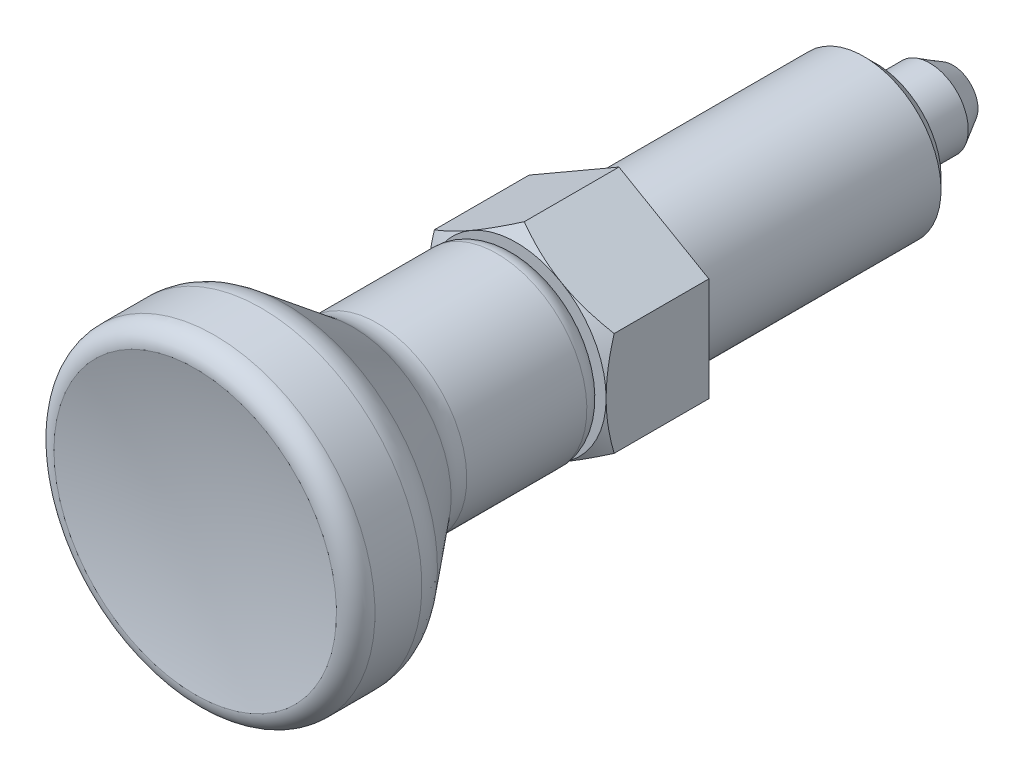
ISO-10303-21;
HEADER;
FILE_DESCRIPTION(('STEP AP214'),'2;1');
FILE_NAME('part.step','',(''),(''),'','','');
FILE_SCHEMA(('AUTOMOTIVE_DESIGN { 1 0 10303 214 1 1 1 1 }'));
ENDSEC;
DATA;
#1=APPLICATION_CONTEXT('core data for automotive mechanical design processes');
#2=APPLICATION_PROTOCOL_DEFINITION('international standard','automotive_design',2000,#1);
#3=PRODUCT_CONTEXT('',#1,'mechanical');
#4=PRODUCT('Part','Part','',(#3));
#5=PRODUCT_RELATED_PRODUCT_CATEGORY('part','',(#4));
#6=PRODUCT_DEFINITION_FORMATION('','',#4);
#7=PRODUCT_DEFINITION_CONTEXT('part definition',#1,'design');
#8=PRODUCT_DEFINITION('design','',#6,#7);
#9=PRODUCT_DEFINITION_SHAPE('','',#8);
#10=(LENGTH_UNIT() NAMED_UNIT(*) SI_UNIT(.MILLI.,.METRE.));
#11=(NAMED_UNIT(*) PLANE_ANGLE_UNIT() SI_UNIT($,.RADIAN.));
#12=(NAMED_UNIT(*) SI_UNIT($,.STERADIAN.) SOLID_ANGLE_UNIT());
#13=UNCERTAINTY_MEASURE_WITH_UNIT(LENGTH_MEASURE(1.E-05),#10,'distance_accuracy_value','');
#14=(GEOMETRIC_REPRESENTATION_CONTEXT(3) GLOBAL_UNCERTAINTY_ASSIGNED_CONTEXT((#13)) GLOBAL_UNIT_ASSIGNED_CONTEXT((#10,
#11,#12)) REPRESENTATION_CONTEXT('',''));
#15=CARTESIAN_POINT('',(0.,0.,0.));
#16=DIRECTION('',(0.,0.,1.));
#17=DIRECTION('',(1.,0.,0.));
#18=AXIS2_PLACEMENT_3D('',#15,#16,#17);
#19=CARTESIAN_POINT('',(0.,0.,5.1132486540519));
#20=DIRECTION('',(0.,0.,-1.));
#21=DIRECTION('',(0.,1.,0.));
#22=AXIS2_PLACEMENT_3D('',#19,#20,#21);
#23=CONICAL_SURFACE('',#22,12.,1.0471975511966);
#24=CARTESIAN_POINT('',(-7.,11.0353922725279,4.49647822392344));
#25=CARTESIAN_POINT('',(-7.,10.7281118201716,4.64624988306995));
#26=CARTESIAN_POINT('',(-7.,10.4201449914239,4.79463653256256));
#27=CARTESIAN_POINT('',(-7.,9.80247425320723,5.0878643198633));
#28=CARTESIAN_POINT('',(-7.,9.49277009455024,5.23270493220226));
#29=CARTESIAN_POINT('',(-7.,8.86974895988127,5.51875597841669));
#30=CARTESIAN_POINT('',(-7.,8.55642158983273,5.65994384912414));
#31=CARTESIAN_POINT('',(-7.,7.92733686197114,5.93677698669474));
#32=CARTESIAN_POINT('',(-7.,7.61157961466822,6.07242250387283));
#33=CARTESIAN_POINT('',(-7.,6.96625895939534,6.34124366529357));
#34=CARTESIAN_POINT('',(-7.,6.63659333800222,6.4741752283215));
#35=CARTESIAN_POINT('',(-7.,5.97347167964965,6.73040545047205));
#36=CARTESIAN_POINT('',(-7.,5.64001523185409,6.85370305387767));
#37=CARTESIAN_POINT('',(-7.,4.96935100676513,7.08755962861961));
#38=CARTESIAN_POINT('',(-7.,4.63215178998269,7.19814291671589));
#39=CARTESIAN_POINT('',(-7.,3.95291539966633,7.40314041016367));
#40=CARTESIAN_POINT('',(-7.,3.61087972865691,7.49755952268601));
#41=CARTESIAN_POINT('',(-7.,2.9237367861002,7.66530671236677));
#42=CARTESIAN_POINT('',(-7.,2.57865959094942,7.73875607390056));
#43=CARTESIAN_POINT('',(-7.,1.88398208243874,7.86053269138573));
#44=CARTESIAN_POINT('',(-7.,1.53438225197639,7.90886260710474));
#45=CARTESIAN_POINT('',(-7.,1.01031452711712,7.95931789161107));
#46=CARTESIAN_POINT('',(-7.,0.836864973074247,7.97244664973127));
#47=CARTESIAN_POINT('',(-7.,0.489558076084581,7.99135622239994));
#48=CARTESIAN_POINT('',(-7.,0.315700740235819,7.99713716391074));
#49=CARTESIAN_POINT('',(-7.,-0.0321006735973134,8.00120458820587));
#50=CARTESIAN_POINT('',(-7.,-0.206044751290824,7.99949109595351));
#51=CARTESIAN_POINT('',(-7.,-0.553702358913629,7.98861566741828));
#52=CARTESIAN_POINT('',(-7.,-0.727415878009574,7.97945339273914));
#53=CARTESIAN_POINT('',(-7.,-1.13958948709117,7.9490742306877));
#54=CARTESIAN_POINT('',(-7.,-1.37781635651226,7.92461864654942));
#55=CARTESIAN_POINT('',(-7.,-1.85260684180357,7.86299260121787));
#56=CARTESIAN_POINT('',(-7.,-2.08917024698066,7.82582055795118));
#57=CARTESIAN_POINT('',(-7.,-2.7960366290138,7.69719189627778));
#58=CARTESIAN_POINT('',(-7.,-3.26327635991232,7.58864282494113));
#59=CARTESIAN_POINT('',(-7.,-3.96216355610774,7.39907211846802));
#60=CARTESIAN_POINT('',(-7.,-4.19739940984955,7.33050662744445));
#61=CARTESIAN_POINT('',(-7.,-4.66559036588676,7.18591768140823));
#62=CARTESIAN_POINT('',(-7.,-4.89854545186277,7.10989417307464));
#63=CARTESIAN_POINT('',(-7.,-5.36224165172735,6.95163657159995));
#64=CARTESIAN_POINT('',(-7.,-5.59298338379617,6.86940427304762));
#65=CARTESIAN_POINT('',(-7.,-6.05253286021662,6.69972997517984));
#66=CARTESIAN_POINT('',(-7.,-6.28134063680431,6.6122880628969));
#67=CARTESIAN_POINT('',(-7.,-6.85526417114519,6.38665091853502));
#68=CARTESIAN_POINT('',(-7.,-7.19926287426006,6.24561832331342));
#69=CARTESIAN_POINT('',(-7.,-7.88401339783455,5.95585423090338));
#70=CARTESIAN_POINT('',(-7.,-8.22476494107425,5.80712208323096));
#71=CARTESIAN_POINT('',(-7.,-8.90368697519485,5.50362622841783));
#72=CARTESIAN_POINT('',(-7.,-9.24185665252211,5.3488607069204));
#73=CARTESIAN_POINT('',(-7.,-9.91598083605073,5.03461804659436));
#74=CARTESIAN_POINT('',(-7.,-10.2519354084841,4.87514104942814));
#75=CARTESIAN_POINT('',(-7.,-10.9224864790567,4.55220470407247));
#76=CARTESIAN_POINT('',(-7.,-11.2570804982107,4.38874021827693));
#77=CARTESIAN_POINT('',(-7.,-11.924759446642,4.0587581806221));
#78=CARTESIAN_POINT('',(-7.,-12.2578443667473,3.89224061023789));
#79=CARTESIAN_POINT('',(-7.,-13.2551078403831,3.389035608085));
#80=CARTESIAN_POINT('',(-7.,-13.9174138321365,3.04863817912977));
#81=CARTESIAN_POINT('',(-7.,-15.1762917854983,2.39342447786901));
#82=CARTESIAN_POINT('',(-7.,-15.7731820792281,2.07921690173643));
#83=CARTESIAN_POINT('',(-7.,-16.9647946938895,1.44665138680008));
#84=CARTESIAN_POINT('',(-7.,-17.559516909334,1.12829324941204));
#85=CARTESIAN_POINT('',(-7.,-18.7455029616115,0.489419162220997));
#86=CARTESIAN_POINT('',(-7.,-19.3367718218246,0.168912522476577));
#87=CARTESIAN_POINT('',(-7.,-20.5179415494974,-0.474518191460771));
#88=CARTESIAN_POINT('',(-7.,-21.1078425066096,-0.797442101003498));
#89=CARTESIAN_POINT('',(-7.,-21.6972508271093,-1.12125672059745));
#90=B_SPLINE_CURVE_WITH_KNOTS('',3,(#24,#25,#26,#27,#28,#29,#30,#31,#32,#33,#34,#35,#36,#37,#38,
#39,#40,#41,#42,#43,#44,#45,#46,#47,#48,#49,#50,#51,#52,#53,#54,#55,#56,#57,#58,#59,#60,#61,#62,
#63,#64,#65,#66,#67,#68,#69,#70,#71,#72,#73,#74,#75,#76,#77,#78,#79,#80,#81,#82,#83,#84,#85,#86,
#87,#88,#89),.UNSPECIFIED.,.F.,.F.,(4,2,2,2,2,2,2,2,2,2,2,2,2,2,2,2,2,2,2,2,2,2,2,2,2,2,2,2,2,2,
2,2,4),(0.,1.02552397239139,2.05119900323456,3.08216150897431,4.11307740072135,5.17933435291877,
6.2457079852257,7.31000695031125,8.37398223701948,9.43167293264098,10.489251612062,
11.0109568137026,11.5326530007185,12.0543474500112,12.5760656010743,13.2941001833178,
14.0122241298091,15.4491895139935,16.1841975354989,16.9192108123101,17.6540124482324,
18.3888018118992,19.5040292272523,20.6193510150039,21.7350108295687,22.85063713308,
23.9677859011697,25.0849414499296,27.3188565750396,29.3424599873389,31.3661605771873,
33.383804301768,35.4013118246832),.UNSPECIFIED.);
#91=CARTESIAN_POINT('',(-7.,-4.0414518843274,7.37478521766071));
#92=VERTEX_POINT('',#91);
#93=CARTESIAN_POINT('',(-7.,0.,8.));
#94=VERTEX_POINT('',#93);
#95=EDGE_CURVE('E9',#92,#94,#90,.F.);
#96=ORIENTED_EDGE('',*,*,#95,.F.);
#97=CARTESIAN_POINT('',(0.000200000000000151,-8.08301923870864,7.37471854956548));
#98=CARTESIAN_POINT('',(-0.153667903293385,-7.99418356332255,7.42600015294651));
#99=CARTESIAN_POINT('',(-0.308109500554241,-7.90501666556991,7.47495440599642));
#100=CARTESIAN_POINT('',(-0.618246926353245,-7.72595873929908,7.56756721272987));
#101=CARTESIAN_POINT('',(-0.773943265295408,-7.63606741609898,7.61122348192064));
#102=CARTESIAN_POINT('',(-1.24352516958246,-7.36495417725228,7.73338840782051));
#103=CARTESIAN_POINT('',(-1.5592643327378,-7.18266208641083,7.80287444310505));
#104=CARTESIAN_POINT('',(-2.03176224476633,-6.90986528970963,7.88435504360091));
#105=CARTESIAN_POINT('',(-2.18710922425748,-6.82017566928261,7.90756651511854));
#106=CARTESIAN_POINT('',(-2.49850511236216,-6.64039116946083,7.94648878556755));
#107=CARTESIAN_POINT('',(-2.65455395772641,-6.55029632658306,7.96220024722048));
#108=CARTESIAN_POINT('',(-2.96692267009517,-6.36995016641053,7.98572208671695));
#109=CARTESIAN_POINT('',(-3.12324202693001,-6.27969914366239,7.99354143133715));
#110=CARTESIAN_POINT('',(-3.43601650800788,-6.09911871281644,8.0011197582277));
#111=CARTESIAN_POINT('',(-3.59247162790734,-6.00878930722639,8.00087898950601));
#112=CARTESIAN_POINT('',(-4.02110687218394,-5.76131663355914,7.98914026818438));
#113=CARTESIAN_POINT('',(-4.29314668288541,-5.60425437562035,7.96943425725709));
#114=CARTESIAN_POINT('',(-4.8354194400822,-5.29117305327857,7.90694653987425));
#115=CARTESIAN_POINT('',(-5.10565047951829,-5.13515508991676,7.86414347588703));
#116=CARTESIAN_POINT('',(-5.64901454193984,-4.8214437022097,7.75714832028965));
#117=CARTESIAN_POINT('',(-5.92207900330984,-4.66378986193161,7.69250290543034));
#118=CARTESIAN_POINT('',(-6.46413578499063,-4.35083323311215,7.54578392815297));
#119=CARTESIAN_POINT('',(-6.73313504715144,-4.19552643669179,7.46374482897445));
#120=CARTESIAN_POINT('',(-7.0002,-4.04133641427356,7.3747185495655));
#121=B_SPLINE_CURVE_WITH_KNOTS('',3,(#97,#98,#99,#100,#101,#102,#103,#104,#105,#106,#107,#108,
#109,#110,#111,#112,#113,#114,#115,#116,#117,#118,#119,#120),.UNSPECIFIED.,.F.,.F.,(4,2,2,2,2,2,
2,2,2,2,2,4),(0.,0.554727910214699,1.1096941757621,2.22193274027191,2.76443041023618,
3.30688013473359,3.84871284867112,4.39052882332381,5.33376515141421,6.27787517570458,
7.24292418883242,8.20607866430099),.UNSPECIFIED.);
#122=CARTESIAN_POINT('',(-3.5,-6.06217782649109,8.));
#123=VERTEX_POINT('',#122);
#124=EDGE_CURVE('E204',#123,#92,#121,.T.);
#125=ORIENTED_EDGE('',*,*,#124,.F.);
#126=CARTESIAN_POINT('',(0.,0.,8.));
#127=DIRECTION('',(0.,0.,1.));
#128=DIRECTION('',(0.,-1.,0.));
#129=AXIS2_PLACEMENT_3D('',#126,#127,#128);
#130=CIRCLE('',#129,7.);
#131=EDGE_CURVE('E262',#94,#123,#130,.T.);
#132=ORIENTED_EDGE('',*,*,#131,.F.);
#133=EDGE_LOOP('',(#96,#125,#132));
#134=FACE_BOUND('',#133,.T.);
#135=ADVANCED_FACE('F14',(#134),#23,.T.);
#136=CARTESIAN_POINT('',(-7.,4.0414518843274,7.37478521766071));
#137=VERTEX_POINT('',#136);
#138=EDGE_CURVE('E18',#94,#137,#90,.F.);
#139=ORIENTED_EDGE('',*,*,#138,.F.);
#140=CARTESIAN_POINT('',(-3.5,6.06217782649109,8.));
#141=VERTEX_POINT('',#140);
#142=EDGE_CURVE('E116',#141,#94,#130,.T.);
#143=ORIENTED_EDGE('',*,*,#142,.F.);
#144=CARTESIAN_POINT('',(-7.0002,4.04133641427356,7.3747185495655));
#145=CARTESIAN_POINT('',(-6.84633209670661,4.13017208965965,7.42600015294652));
#146=CARTESIAN_POINT('',(-6.69189049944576,4.21933898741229,7.47495440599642));
#147=CARTESIAN_POINT('',(-6.38175307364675,4.39839691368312,7.56756721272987));
#148=CARTESIAN_POINT('',(-6.22605673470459,4.48828823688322,7.61122348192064));
#149=CARTESIAN_POINT('',(-5.75647483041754,4.75940147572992,7.73338840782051));
#150=CARTESIAN_POINT('',(-5.4407356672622,4.94169356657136,7.80287444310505));
#151=CARTESIAN_POINT('',(-4.96823775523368,5.21449036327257,7.88435504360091));
#152=CARTESIAN_POINT('',(-4.81289077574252,5.30417998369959,7.90756651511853));
#153=CARTESIAN_POINT('',(-4.50149488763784,5.48396448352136,7.94648878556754));
#154=CARTESIAN_POINT('',(-4.3454460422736,5.57405932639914,7.96220024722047));
#155=CARTESIAN_POINT('',(-4.03307732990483,5.75440548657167,7.98572208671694));
#156=CARTESIAN_POINT('',(-3.87675797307,5.84465650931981,7.99354143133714));
#157=CARTESIAN_POINT('',(-3.56398349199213,6.02523694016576,8.00111975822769));
#158=CARTESIAN_POINT('',(-3.40752837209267,6.11556634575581,8.000878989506));
#159=CARTESIAN_POINT('',(-2.97889312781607,6.36303901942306,7.98914026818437));
#160=CARTESIAN_POINT('',(-2.7068533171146,6.52010127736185,7.96943425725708));
#161=CARTESIAN_POINT('',(-2.1645805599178,6.83318259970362,7.90694653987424));
#162=CARTESIAN_POINT('',(-1.89434952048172,6.98920056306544,7.86414347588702));
#163=CARTESIAN_POINT('',(-1.35098545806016,7.3029119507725,7.75714832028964));
#164=CARTESIAN_POINT('',(-1.07792099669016,7.46056579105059,7.69250290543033));
#165=CARTESIAN_POINT('',(-0.535864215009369,7.77352241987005,7.54578392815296));
#166=CARTESIAN_POINT('',(-0.266864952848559,7.92882921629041,7.46374482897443));
#167=CARTESIAN_POINT('',(0.00019999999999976,8.08301923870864,7.37471854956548));
#168=B_SPLINE_CURVE_WITH_KNOTS('',3,(#144,#145,#146,#147,#148,#149,#150,#151,#152,#153,#154,
#155,#156,#157,#158,#159,#160,#161,#162,#163,#164,#165,#166,#167),.UNSPECIFIED.,.F.,.F.,(4,2,2,
2,2,2,2,2,2,2,2,4),(0.,0.554727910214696,1.10969417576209,2.2219327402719,2.76443041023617,
3.30688013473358,3.8487128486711,4.3905288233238,5.3337651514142,6.27787517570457,
7.24292418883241,8.20607866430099),.UNSPECIFIED.);
#169=EDGE_CURVE('E265',#137,#141,#168,.T.);
#170=ORIENTED_EDGE('',*,*,#169,.F.);
#171=EDGE_LOOP('',(#139,#143,#170));
#172=FACE_BOUND('',#171,.T.);
#173=ADVANCED_FACE('F226',(#172),#23,.T.);
#174=CARTESIAN_POINT('',(0.,8.0829037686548,7.3747852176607));
#175=VERTEX_POINT('',#174);
#176=EDGE_CURVE('E112',#141,#175,#168,.T.);
#177=ORIENTED_EDGE('',*,*,#176,.F.);
#178=CARTESIAN_POINT('',(3.5,6.06217782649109,8.));
#179=VERTEX_POINT('',#178);
#180=EDGE_CURVE('E110',#179,#141,#130,.T.);
#181=ORIENTED_EDGE('',*,*,#180,.F.);
#182=CARTESIAN_POINT('',(-0.000200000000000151,8.08301923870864,7.37471854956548));
#183=CARTESIAN_POINT('',(0.153667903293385,7.99418356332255,7.42600015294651));
#184=CARTESIAN_POINT('',(0.308109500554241,7.90501666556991,7.47495440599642));
#185=CARTESIAN_POINT('',(0.618246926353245,7.72595873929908,7.56756721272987));
#186=CARTESIAN_POINT('',(0.773943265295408,7.63606741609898,7.61122348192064));
#187=CARTESIAN_POINT('',(1.24352516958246,7.36495417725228,7.73338840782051));
#188=CARTESIAN_POINT('',(1.5592643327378,7.18266208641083,7.80287444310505));
#189=CARTESIAN_POINT('',(2.03176224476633,6.90986528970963,7.88435504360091));
#190=CARTESIAN_POINT('',(2.18710922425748,6.82017566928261,7.90756651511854));
#191=CARTESIAN_POINT('',(2.49850511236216,6.64039116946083,7.94648878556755));
#192=CARTESIAN_POINT('',(2.65455395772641,6.55029632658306,7.96220024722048));
#193=CARTESIAN_POINT('',(2.96692267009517,6.36995016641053,7.98572208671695));
#194=CARTESIAN_POINT('',(3.12324202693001,6.27969914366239,7.99354143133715));
#195=CARTESIAN_POINT('',(3.43601650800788,6.09911871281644,8.0011197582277));
#196=CARTESIAN_POINT('',(3.59247162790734,6.00878930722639,8.00087898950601));
#197=CARTESIAN_POINT('',(4.02110687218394,5.76131663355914,7.98914026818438));
#198=CARTESIAN_POINT('',(4.29314668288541,5.60425437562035,7.96943425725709));
#199=CARTESIAN_POINT('',(4.8354194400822,5.29117305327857,7.90694653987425));
#200=CARTESIAN_POINT('',(5.10565047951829,5.13515508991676,7.86414347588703));
#201=CARTESIAN_POINT('',(5.64901454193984,4.8214437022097,7.75714832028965));
#202=CARTESIAN_POINT('',(5.92207900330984,4.66378986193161,7.69250290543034));
#203=CARTESIAN_POINT('',(6.46413578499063,4.35083323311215,7.54578392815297));
#204=CARTESIAN_POINT('',(6.73313504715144,4.19552643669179,7.46374482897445));
#205=CARTESIAN_POINT('',(7.0002,4.04133641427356,7.3747185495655));
#206=B_SPLINE_CURVE_WITH_KNOTS('',3,(#182,#183,#184,#185,#186,#187,#188,#189,#190,#191,#192,
#193,#194,#195,#196,#197,#198,#199,#200,#201,#202,#203,#204,#205),.UNSPECIFIED.,.F.,.F.,(4,2,2,
2,2,2,2,2,2,2,2,4),(0.,0.554727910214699,1.1096941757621,2.22193274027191,2.76443041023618,
3.30688013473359,3.84871284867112,4.39052882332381,5.33376515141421,6.27787517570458,
7.24292418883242,8.20607866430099),.UNSPECIFIED.);
#207=EDGE_CURVE('E90',#175,#179,#206,.T.);
#208=ORIENTED_EDGE('',*,*,#207,.F.);
#209=EDGE_LOOP('',(#177,#181,#208));
#210=FACE_BOUND('',#209,.T.);
#211=ADVANCED_FACE('F111',(#210),#23,.T.);
#212=CARTESIAN_POINT('',(0.,-8.0829037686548,7.3747852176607));
#213=VERTEX_POINT('',#212);
#214=EDGE_CURVE('E199',#213,#123,#121,.T.);
#215=ORIENTED_EDGE('',*,*,#214,.F.);
#216=CARTESIAN_POINT('',(7.0002,-4.04133641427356,7.3747185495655));
#217=CARTESIAN_POINT('',(6.84633209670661,-4.13017208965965,7.42600015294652));
#218=CARTESIAN_POINT('',(6.69189049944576,-4.21933898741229,7.47495440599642));
#219=CARTESIAN_POINT('',(6.38175307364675,-4.39839691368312,7.56756721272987));
#220=CARTESIAN_POINT('',(6.22605673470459,-4.48828823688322,7.61122348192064));
#221=CARTESIAN_POINT('',(5.75647483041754,-4.75940147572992,7.73338840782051));
#222=CARTESIAN_POINT('',(5.4407356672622,-4.94169356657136,7.80287444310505));
#223=CARTESIAN_POINT('',(4.96823775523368,-5.21449036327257,7.88435504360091));
#224=CARTESIAN_POINT('',(4.81289077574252,-5.30417998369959,7.90756651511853));
#225=CARTESIAN_POINT('',(4.50149488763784,-5.48396448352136,7.94648878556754));
#226=CARTESIAN_POINT('',(4.3454460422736,-5.57405932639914,7.96220024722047));
#227=CARTESIAN_POINT('',(4.03307732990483,-5.75440548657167,7.98572208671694));
#228=CARTESIAN_POINT('',(3.87675797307,-5.84465650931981,7.99354143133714));
#229=CARTESIAN_POINT('',(3.56398349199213,-6.02523694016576,8.00111975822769));
#230=CARTESIAN_POINT('',(3.40752837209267,-6.11556634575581,8.000878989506));
#231=CARTESIAN_POINT('',(2.97889312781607,-6.36303901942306,7.98914026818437));
#232=CARTESIAN_POINT('',(2.7068533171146,-6.52010127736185,7.96943425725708));
#233=CARTESIAN_POINT('',(2.1645805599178,-6.83318259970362,7.90694653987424));
#234=CARTESIAN_POINT('',(1.89434952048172,-6.98920056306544,7.86414347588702));
#235=CARTESIAN_POINT('',(1.35098545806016,-7.3029119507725,7.75714832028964));
#236=CARTESIAN_POINT('',(1.07792099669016,-7.46056579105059,7.69250290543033));
#237=CARTESIAN_POINT('',(0.535864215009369,-7.77352241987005,7.54578392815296));
#238=CARTESIAN_POINT('',(0.266864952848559,-7.92882921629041,7.46374482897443));
#239=CARTESIAN_POINT('',(-0.00019999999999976,-8.08301923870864,7.37471854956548));
#240=B_SPLINE_CURVE_WITH_KNOTS('',3,(#216,#217,#218,#219,#220,#221,#222,#223,#224,#225,#226,
#227,#228,#229,#230,#231,#232,#233,#234,#235,#236,#237,#238,#239),.UNSPECIFIED.,.F.,.F.,(4,2,2,
2,2,2,2,2,2,2,2,4),(0.,0.554727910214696,1.10969417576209,2.2219327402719,2.76443041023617,
3.30688013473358,3.8487128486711,4.3905288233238,5.3337651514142,6.27787517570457,
7.24292418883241,8.20607866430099),.UNSPECIFIED.);
#241=CARTESIAN_POINT('',(3.5,-6.06217782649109,8.));
#242=VERTEX_POINT('',#241);
#243=EDGE_CURVE('E100',#242,#213,#240,.T.);
#244=ORIENTED_EDGE('',*,*,#243,.F.);
#245=EDGE_CURVE('E123',#123,#242,#130,.T.);
#246=ORIENTED_EDGE('',*,*,#245,.F.);
#247=EDGE_LOOP('',(#215,#244,#246));
#248=FACE_BOUND('',#247,.T.);
#249=ADVANCED_FACE('F244',(#248),#23,.T.);
#250=CARTESIAN_POINT('',(7.,4.0414518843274,7.37478521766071));
#251=VERTEX_POINT('',#250);
#252=EDGE_CURVE('E94',#179,#251,#206,.T.);
#253=ORIENTED_EDGE('',*,*,#252,.F.);
#254=CARTESIAN_POINT('',(7.,0.,8.));
#255=VERTEX_POINT('',#254);
#256=EDGE_CURVE('E106',#255,#179,#130,.T.);
#257=ORIENTED_EDGE('',*,*,#256,.F.);
#258=CARTESIAN_POINT('',(7.,11.0353922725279,4.49647822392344));
#259=CARTESIAN_POINT('',(7.,10.7281118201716,4.64624988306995));
#260=CARTESIAN_POINT('',(7.,10.4201449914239,4.79463653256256));
#261=CARTESIAN_POINT('',(7.,9.80247425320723,5.0878643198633));
#262=CARTESIAN_POINT('',(7.,9.49277009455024,5.23270493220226));
#263=CARTESIAN_POINT('',(7.,8.86974895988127,5.51875597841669));
#264=CARTESIAN_POINT('',(7.,8.55642158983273,5.65994384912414));
#265=CARTESIAN_POINT('',(7.,7.92733686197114,5.93677698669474));
#266=CARTESIAN_POINT('',(7.,7.61157961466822,6.07242250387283));
#267=CARTESIAN_POINT('',(7.,6.96625895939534,6.34124366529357));
#268=CARTESIAN_POINT('',(7.,6.63659333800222,6.4741752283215));
#269=CARTESIAN_POINT('',(7.,5.97347167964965,6.73040545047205));
#270=CARTESIAN_POINT('',(7.,5.64001523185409,6.85370305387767));
#271=CARTESIAN_POINT('',(7.,4.96935100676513,7.08755962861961));
#272=CARTESIAN_POINT('',(7.,4.63215178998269,7.19814291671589));
#273=CARTESIAN_POINT('',(7.,3.95291539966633,7.40314041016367));
#274=CARTESIAN_POINT('',(7.,3.61087972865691,7.49755952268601));
#275=CARTESIAN_POINT('',(7.,2.9237367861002,7.66530671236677));
#276=CARTESIAN_POINT('',(7.,2.57865959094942,7.73875607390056));
#277=CARTESIAN_POINT('',(7.,1.88398208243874,7.86053269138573));
#278=CARTESIAN_POINT('',(7.,1.53438225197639,7.90886260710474));
#279=CARTESIAN_POINT('',(7.,1.01031452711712,7.95931789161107));
#280=CARTESIAN_POINT('',(7.,0.836864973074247,7.97244664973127));
#281=CARTESIAN_POINT('',(7.,0.489558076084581,7.99135622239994));
#282=CARTESIAN_POINT('',(7.,0.315700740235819,7.99713716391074));
#283=CARTESIAN_POINT('',(7.,-0.0321006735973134,8.00120458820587));
#284=CARTESIAN_POINT('',(7.,-0.206044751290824,7.99949109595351));
#285=CARTESIAN_POINT('',(7.,-0.553702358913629,7.98861566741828));
#286=CARTESIAN_POINT('',(7.,-0.727415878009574,7.97945339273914));
#287=CARTESIAN_POINT('',(7.,-1.13958948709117,7.9490742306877));
#288=CARTESIAN_POINT('',(7.,-1.37781635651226,7.92461864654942));
#289=CARTESIAN_POINT('',(7.,-1.85260684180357,7.86299260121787));
#290=CARTESIAN_POINT('',(7.,-2.08917024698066,7.82582055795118));
#291=CARTESIAN_POINT('',(7.,-2.7960366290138,7.69719189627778));
#292=CARTESIAN_POINT('',(7.,-3.26327635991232,7.58864282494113));
#293=CARTESIAN_POINT('',(7.,-3.96216355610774,7.39907211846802));
#294=CARTESIAN_POINT('',(7.,-4.19739940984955,7.33050662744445));
#295=CARTESIAN_POINT('',(7.,-4.66559036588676,7.18591768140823));
#296=CARTESIAN_POINT('',(7.,-4.89854545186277,7.10989417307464));
#297=CARTESIAN_POINT('',(7.,-5.36224165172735,6.95163657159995));
#298=CARTESIAN_POINT('',(7.,-5.59298338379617,6.86940427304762));
#299=CARTESIAN_POINT('',(7.,-6.05253286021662,6.69972997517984));
#300=CARTESIAN_POINT('',(7.,-6.28134063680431,6.6122880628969));
#301=CARTESIAN_POINT('',(7.,-6.85526417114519,6.38665091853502));
#302=CARTESIAN_POINT('',(7.,-7.19926287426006,6.24561832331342));
#303=CARTESIAN_POINT('',(7.,-7.88401339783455,5.95585423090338));
#304=CARTESIAN_POINT('',(7.,-8.22476494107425,5.80712208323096));
#305=CARTESIAN_POINT('',(7.,-8.90368697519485,5.50362622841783));
#306=CARTESIAN_POINT('',(7.,-9.24185665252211,5.3488607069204));
#307=CARTESIAN_POINT('',(7.,-9.91598083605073,5.03461804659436));
#308=CARTESIAN_POINT('',(7.,-10.2519354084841,4.87514104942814));
#309=CARTESIAN_POINT('',(7.,-10.9224864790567,4.55220470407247));
#310=CARTESIAN_POINT('',(7.,-11.2570804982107,4.38874021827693));
#311=CARTESIAN_POINT('',(7.,-11.924759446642,4.0587581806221));
#312=CARTESIAN_POINT('',(7.,-12.2578443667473,3.89224061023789));
#313=CARTESIAN_POINT('',(7.,-13.2551078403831,3.389035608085));
#314=CARTESIAN_POINT('',(7.,-13.9174138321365,3.04863817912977));
#315=CARTESIAN_POINT('',(7.,-15.1762917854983,2.39342447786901));
#316=CARTESIAN_POINT('',(7.,-15.7731820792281,2.07921690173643));
#317=CARTESIAN_POINT('',(7.,-16.9647946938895,1.44665138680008));
#318=CARTESIAN_POINT('',(7.,-17.559516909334,1.12829324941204));
#319=CARTESIAN_POINT('',(7.,-18.7455029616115,0.489419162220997));
#320=CARTESIAN_POINT('',(7.,-19.3367718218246,0.168912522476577));
#321=CARTESIAN_POINT('',(7.,-20.5179415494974,-0.474518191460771));
#322=CARTESIAN_POINT('',(7.,-21.1078425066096,-0.797442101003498));
#323=CARTESIAN_POINT('',(7.,-21.6972508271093,-1.12125672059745));
#324=B_SPLINE_CURVE_WITH_KNOTS('',3,(#258,#259,#260,#261,#262,#263,#264,#265,#266,#267,#268,
#269,#270,#271,#272,#273,#274,#275,#276,#277,#278,#279,#280,#281,#282,#283,#284,#285,#286,#287,
#288,#289,#290,#291,#292,#293,#294,#295,#296,#297,#298,#299,#300,#301,#302,#303,#304,#305,#306,
#307,#308,#309,#310,#311,#312,#313,#314,#315,#316,#317,#318,#319,#320,#321,#322,#323),
.UNSPECIFIED.,.F.,.F.,(4,2,2,2,2,2,2,2,2,2,2,2,2,2,2,2,2,2,2,2,2,2,2,2,2,2,2,2,2,2,2,2,4),(0.,
1.02552397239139,2.05119900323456,3.08216150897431,4.11307740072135,5.17933435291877,
6.2457079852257,7.31000695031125,8.37398223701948,9.43167293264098,10.489251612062,
11.0109568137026,11.5326530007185,12.0543474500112,12.5760656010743,13.2941001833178,
14.0122241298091,15.4491895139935,16.1841975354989,16.9192108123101,17.6540124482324,
18.3888018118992,19.5040292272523,20.6193510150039,21.7350108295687,22.85063713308,
23.9677859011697,25.0849414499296,27.3188565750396,29.3424599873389,31.3661605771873,
33.383804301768,35.4013118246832),.UNSPECIFIED.);
#325=EDGE_CURVE('E41',#251,#255,#324,.T.);
#326=ORIENTED_EDGE('',*,*,#325,.F.);
#327=EDGE_LOOP('',(#253,#257,#326));
#328=FACE_BOUND('',#327,.T.);
#329=ADVANCED_FACE('F104',(#328),#23,.T.);
#330=CARTESIAN_POINT('',(7.,-4.0414518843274,7.37478521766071));
#331=VERTEX_POINT('',#330);
#332=EDGE_CURVE('E108',#331,#242,#240,.T.);
#333=ORIENTED_EDGE('',*,*,#332,.F.);
#334=EDGE_CURVE('E169',#255,#331,#324,.T.);
#335=ORIENTED_EDGE('',*,*,#334,.F.);
#336=EDGE_CURVE('E121',#242,#255,#130,.T.);
#337=ORIENTED_EDGE('',*,*,#336,.F.);
#338=EDGE_LOOP('',(#333,#335,#337));
#339=FACE_BOUND('',#338,.T.);
#340=ADVANCED_FACE('F228',(#339),#23,.T.);
#341=CARTESIAN_POINT('',(3.33760796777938E-12,0.,81.7749935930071));
#342=DIRECTION('',(0.,0.,1.));
#343=DIRECTION('',(-1.,0.,0.));
#344=AXIS2_PLACEMENT_3D('',#341,#342,#343);
#345=SPHERICAL_SURFACE('',#344,49.9999999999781);
#346=CARTESIAN_POINT('',(0.,0.,33.));
#347=DIRECTION('',(0.,0.,1.));
#348=DIRECTION('',(0.,-1.,0.));
#349=AXIS2_PLACEMENT_3D('',#346,#347,#348);
#350=CIRCLE('',#349,11.);
#351=CARTESIAN_POINT('',(0.,-11.,33.));
#352=VERTEX_POINT('',#351);
#353=EDGE_CURVE('E166',#352,#352,#350,.T.);
#354=ORIENTED_EDGE('',*,*,#353,.T.);
#355=EDGE_LOOP('',(#354));
#356=FACE_BOUND('',#355,.T.);
#357=ADVANCED_FACE('F16',(#356),#345,.F.);
#358=CARTESIAN_POINT('',(0.,0.,31.5000000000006));
#359=DIRECTION('',(0.,0.,1.));
#360=DIRECTION('',(0.,-1.,0.));
#361=AXIS2_PLACEMENT_3D('',#358,#359,#360);
#362=TOROIDAL_SURFACE('',#361,11.0000000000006,1.49999999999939);
#363=CARTESIAN_POINT('',(0.,0.,31.5));
#364=DIRECTION('',(0.,0.,1.));
#365=DIRECTION('',(0.,-1.,0.));
#366=AXIS2_PLACEMENT_3D('',#363,#364,#365);
#367=CIRCLE('',#366,12.5);
#368=CARTESIAN_POINT('',(0.,-12.5,31.5));
#369=VERTEX_POINT('',#368);
#370=EDGE_CURVE('E163',#369,#369,#367,.T.);
#371=ORIENTED_EDGE('',*,*,#370,.T.);
#372=EDGE_LOOP('',(#371));
#373=FACE_BOUND('',#372,.T.);
#374=ORIENTED_EDGE('',*,*,#353,.F.);
#375=EDGE_LOOP('',(#374));
#376=FACE_BOUND('',#375,.T.);
#377=ADVANCED_FACE('F242',(#373,#376),#362,.T.);
#378=CARTESIAN_POINT('',(0.,0.,-26.));
#379=DIRECTION('',(0.,0.,1.));
#380=DIRECTION('',(0.,-1.,0.));
#381=AXIS2_PLACEMENT_3D('',#378,#379,#380);
#382=CYLINDRICAL_SURFACE('',#381,12.5);
#383=CARTESIAN_POINT('',(0.,0.,27.849362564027));
#384=DIRECTION('',(0.,0.,1.));
#385=DIRECTION('',(0.,-1.,0.));
#386=AXIS2_PLACEMENT_3D('',#383,#384,#385);
#387=CIRCLE('',#386,12.5);
#388=CARTESIAN_POINT('',(0.,-12.5,27.849362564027));
#389=VERTEX_POINT('',#388);
#390=EDGE_CURVE('E160',#389,#389,#387,.T.);
#391=ORIENTED_EDGE('',*,*,#390,.T.);
#392=EDGE_LOOP('',(#391));
#393=FACE_BOUND('',#392,.T.);
#394=ORIENTED_EDGE('',*,*,#370,.F.);
#395=EDGE_LOOP('',(#394));
#396=FACE_BOUND('',#395,.T.);
#397=ADVANCED_FACE('F342',(#393,#396),#382,.T.);
#398=CARTESIAN_POINT('',(0.,0.,27.8493625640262));
#399=DIRECTION('',(0.,0.,1.));
#400=DIRECTION('',(0.,-1.,0.));
#401=AXIS2_PLACEMENT_3D('',#398,#399,#400);
#402=TOROIDAL_SURFACE('',#401,9.49999999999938,3.00000000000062);
#403=CARTESIAN_POINT('',(0.,0.,25.979426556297));
#404=DIRECTION('',(0.,0.,1.));
#405=DIRECTION('',(0.,-1.,0.));
#406=AXIS2_PLACEMENT_3D('',#403,#404,#405);
#407=CIRCLE('',#406,11.845919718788);
#408=CARTESIAN_POINT('',(0.,-11.845919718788,25.979426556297));
#409=VERTEX_POINT('',#408);
#410=EDGE_CURVE('E157',#409,#409,#407,.T.);
#411=ORIENTED_EDGE('',*,*,#410,.T.);
#412=EDGE_LOOP('',(#411));
#413=FACE_BOUND('',#412,.T.);
#414=ORIENTED_EDGE('',*,*,#390,.F.);
#415=EDGE_LOOP('',(#414));
#416=FACE_BOUND('',#415,.T.);
#417=ADVANCED_FACE('F338',(#413,#416),#402,.T.);
#418=CARTESIAN_POINT('',(0.,0.,25.979426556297));
#419=DIRECTION('',(0.,0.,1.));
#420=DIRECTION('',(0.,-1.,0.));
#421=AXIS2_PLACEMENT_3D('',#418,#419,#420);
#422=CONICAL_SURFACE('',#421,11.845919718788,0.672971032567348);
#423=CARTESIAN_POINT('',(0.,0.,20.720573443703));
#424=DIRECTION('',(0.,0.,1.));
#425=DIRECTION('',(0.,-1.,0.));
#426=AXIS2_PLACEMENT_3D('',#423,#424,#425);
#427=CIRCLE('',#426,7.6540802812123);
#428=CARTESIAN_POINT('',(0.,-7.6540802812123,20.720573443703));
#429=VERTEX_POINT('',#428);
#430=EDGE_CURVE('E154',#429,#429,#427,.T.);
#431=ORIENTED_EDGE('',*,*,#430,.T.);
#432=EDGE_LOOP('',(#431));
#433=FACE_BOUND('',#432,.T.);
#434=ORIENTED_EDGE('',*,*,#410,.F.);
#435=EDGE_LOOP('',(#434));
#436=FACE_BOUND('',#435,.T.);
#437=ADVANCED_FACE('F334',(#433,#436),#422,.T.);
#438=CARTESIAN_POINT('',(0.,0.,18.850637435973));
#439=DIRECTION('',(0.,0.,1.));
#440=DIRECTION('',(0.,-1.,0.));
#441=AXIS2_PLACEMENT_3D('',#438,#439,#440);
#442=TOROIDAL_SURFACE('',#441,10.0000000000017,3.0000000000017);
#443=CARTESIAN_POINT('',(0.,0.,18.850637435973));
#444=DIRECTION('',(0.,0.,1.));
#445=DIRECTION('',(0.,-1.,0.));
#446=AXIS2_PLACEMENT_3D('',#443,#444,#445);
#447=CIRCLE('',#446,7.);
#448=CARTESIAN_POINT('',(0.,-7.,18.850637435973));
#449=VERTEX_POINT('',#448);
#450=EDGE_CURVE('E151',#449,#449,#447,.T.);
#451=ORIENTED_EDGE('',*,*,#450,.T.);
#452=EDGE_LOOP('',(#451));
#453=FACE_BOUND('',#452,.T.);
#454=ORIENTED_EDGE('',*,*,#430,.F.);
#455=EDGE_LOOP('',(#454));
#456=FACE_BOUND('',#455,.T.);
#457=ADVANCED_FACE('F330',(#453,#456),#442,.F.);
#458=CARTESIAN_POINT('',(0.,0.,-26.));
#459=DIRECTION('',(0.,0.,1.));
#460=DIRECTION('',(0.,-1.,0.));
#461=AXIS2_PLACEMENT_3D('',#458,#459,#460);
#462=CYLINDRICAL_SURFACE('',#461,7.);
#463=CARTESIAN_POINT('',(0.,0.,9.5));
#464=DIRECTION('',(0.,0.,1.));
#465=DIRECTION('',(0.,-1.,0.));
#466=AXIS2_PLACEMENT_3D('',#463,#464,#465);
#467=CIRCLE('',#466,7.);
#468=CARTESIAN_POINT('',(0.,-7.,9.5));
#469=VERTEX_POINT('',#468);
#470=EDGE_CURVE('E148',#469,#469,#467,.T.);
#471=ORIENTED_EDGE('',*,*,#470,.T.);
#472=EDGE_LOOP('',(#471));
#473=FACE_BOUND('',#472,.T.);
#474=ORIENTED_EDGE('',*,*,#450,.F.);
#475=EDGE_LOOP('',(#474));
#476=FACE_BOUND('',#475,.T.);
#477=ADVANCED_FACE('F326',(#473,#476),#462,.T.);
#478=CARTESIAN_POINT('',(0.,0.,9.5));
#479=DIRECTION('',(0.,0.,1.));
#480=DIRECTION('',(0.,-1.,0.));
#481=AXIS2_PLACEMENT_3D('',#478,#479,#480);
#482=TOROIDAL_SURFACE('',#481,5.5,1.50000000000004);
#483=CARTESIAN_POINT('',(0.,0.,8.));
#484=DIRECTION('',(0.,0.,1.));
#485=DIRECTION('',(0.,-1.,0.));
#486=AXIS2_PLACEMENT_3D('',#483,#484,#485);
#487=CIRCLE('',#486,5.5);
#488=CARTESIAN_POINT('',(0.,-5.5,8.));
#489=VERTEX_POINT('',#488);
#490=EDGE_CURVE('E145',#489,#489,#487,.T.);
#491=ORIENTED_EDGE('',*,*,#490,.T.);
#492=EDGE_LOOP('',(#491));
#493=FACE_BOUND('',#492,.T.);
#494=ORIENTED_EDGE('',*,*,#470,.F.);
#495=EDGE_LOOP('',(#494));
#496=FACE_BOUND('',#495,.T.);
#497=ADVANCED_FACE('F315',(#493,#496),#482,.T.);
#498=CARTESIAN_POINT('',(7.,0.,8.));
#499=DIRECTION('',(0.,0.,-1.));
#500=DIRECTION('',(0.,1.,0.));
#501=AXIS2_PLACEMENT_3D('',#498,#499,#500);
#502=PLANE('',#501);
#503=ORIENTED_EDGE('',*,*,#490,.F.);
#504=EDGE_LOOP('',(#503));
#505=FACE_BOUND('',#504,.T.);
#506=ORIENTED_EDGE('',*,*,#336,.T.);
#507=ORIENTED_EDGE('',*,*,#256,.T.);
#508=ORIENTED_EDGE('',*,*,#180,.T.);
#509=ORIENTED_EDGE('',*,*,#142,.T.);
#510=ORIENTED_EDGE('',*,*,#131,.T.);
#511=ORIENTED_EDGE('',*,*,#245,.T.);
#512=EDGE_LOOP('',(#506,#507,#508,#509,#510,#511));
#513=FACE_BOUND('',#512,.T.);
#514=ADVANCED_FACE('F118',(#505,#513),#502,.F.);
#515=CARTESIAN_POINT('',(7.,4.0414518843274,-2.));
#516=DIRECTION('',(0.5,0.866025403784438,0.));
#517=DIRECTION('',(-0.866025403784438,0.5,0.));
#518=AXIS2_PLACEMENT_3D('',#515,#516,#517);
#519=PLANE('',#518);
#520=DIRECTION('',(-0.866025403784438,0.5,0.));
#521=VECTOR('',#520,1.);
#522=CARTESIAN_POINT('',(8.,3.46410161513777,0.));
#523=LINE('',#522,#521);
#524=CARTESIAN_POINT('',(7.,4.0414518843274,0.));
#525=VERTEX_POINT('',#524);
#526=CARTESIAN_POINT('',(0.,8.0829037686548,0.));
#527=VERTEX_POINT('',#526);
#528=EDGE_CURVE('E126',#525,#527,#523,.T.);
#529=ORIENTED_EDGE('',*,*,#528,.T.);
#530=DIRECTION('',(0.,0.,1.));
#531=VECTOR('',#530,1.);
#532=CARTESIAN_POINT('',(0.,8.0829037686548,-2.));
#533=LINE('',#532,#531);
#534=EDGE_CURVE('E96',#527,#175,#533,.T.);
#535=ORIENTED_EDGE('',*,*,#534,.T.);
#536=ORIENTED_EDGE('',*,*,#207,.T.);
#537=ORIENTED_EDGE('',*,*,#252,.T.);
#538=DIRECTION('',(0.,0.,1.));
#539=VECTOR('',#538,1.);
#540=CARTESIAN_POINT('',(7.,4.0414518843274,-2.));
#541=LINE('',#540,#539);
#542=EDGE_CURVE('E285',#525,#251,#541,.T.);
#543=ORIENTED_EDGE('',*,*,#542,.F.);
#544=EDGE_LOOP('',(#529,#535,#536,#537,#543));
#545=FACE_BOUND('',#544,.T.);
#546=ADVANCED_FACE('F92',(#545),#519,.T.);
#547=CARTESIAN_POINT('',(0.,8.0829037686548,-2.));
#548=DIRECTION('',(-0.5,0.866025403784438,0.));
#549=DIRECTION('',(-0.866025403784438,-0.5,0.));
#550=AXIS2_PLACEMENT_3D('',#547,#548,#549);
#551=PLANE('',#550);
#552=DIRECTION('',(-0.866025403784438,-0.5,0.));
#553=VECTOR('',#552,1.);
#554=CARTESIAN_POINT('',(0.999999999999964,8.66025403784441,0.));
#555=LINE('',#554,#553);
#556=CARTESIAN_POINT('',(-7.,4.0414518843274,0.));
#557=VERTEX_POINT('',#556);
#558=EDGE_CURVE('E269',#527,#557,#555,.T.);
#559=ORIENTED_EDGE('',*,*,#558,.T.);
#560=DIRECTION('',(0.,0.,1.));
#561=VECTOR('',#560,1.);
#562=CARTESIAN_POINT('',(-7.,4.0414518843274,-2.));
#563=LINE('',#562,#561);
#564=EDGE_CURVE('E272',#557,#137,#563,.T.);
#565=ORIENTED_EDGE('',*,*,#564,.T.);
#566=ORIENTED_EDGE('',*,*,#169,.T.);
#567=ORIENTED_EDGE('',*,*,#176,.T.);
#568=ORIENTED_EDGE('',*,*,#534,.F.);
#569=EDGE_LOOP('',(#559,#565,#566,#567,#568));
#570=FACE_BOUND('',#569,.T.);
#571=ADVANCED_FACE('F193',(#570),#551,.T.);
#572=CARTESIAN_POINT('',(-7.,4.0414518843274,-2.));
#573=DIRECTION('',(-1.,0.,0.));
#574=DIRECTION('',(0.,-1.,0.));
#575=AXIS2_PLACEMENT_3D('',#572,#573,#574);
#576=PLANE('',#575);
#577=DIRECTION('',(0.,-1.,0.));
#578=VECTOR('',#577,1.);
#579=CARTESIAN_POINT('',(-7.,0.,0.));
#580=LINE('',#579,#578);
#581=CARTESIAN_POINT('',(-7.,-4.0414518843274,0.));
#582=VERTEX_POINT('',#581);
#583=EDGE_CURVE('E278',#557,#582,#580,.T.);
#584=ORIENTED_EDGE('',*,*,#583,.T.);
#585=DIRECTION('',(0.,0.,1.));
#586=VECTOR('',#585,1.);
#587=CARTESIAN_POINT('',(-7.,-4.0414518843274,-2.));
#588=LINE('',#587,#586);
#589=EDGE_CURVE('E259',#582,#92,#588,.T.);
#590=ORIENTED_EDGE('',*,*,#589,.T.);
#591=ORIENTED_EDGE('',*,*,#95,.T.);
#592=ORIENTED_EDGE('',*,*,#138,.T.);
#593=ORIENTED_EDGE('',*,*,#564,.F.);
#594=EDGE_LOOP('',(#584,#590,#591,#592,#593));
#595=FACE_BOUND('',#594,.T.);
#596=ADVANCED_FACE('F213',(#595),#576,.T.);
#597=CARTESIAN_POINT('',(-7.,-4.0414518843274,-2.));
#598=DIRECTION('',(-0.5,-0.866025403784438,0.));
#599=DIRECTION('',(0.866025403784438,-0.5,0.));
#600=AXIS2_PLACEMENT_3D('',#597,#598,#599);
#601=PLANE('',#600);
#602=DIRECTION('',(0.866025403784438,-0.5,0.));
#603=VECTOR('',#602,1.);
#604=CARTESIAN_POINT('',(0.999999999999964,-8.66025403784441,0.));
#605=LINE('',#604,#603);
#606=CARTESIAN_POINT('',(0.,-8.0829037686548,0.));
#607=VERTEX_POINT('',#606);
#608=EDGE_CURVE('E258',#582,#607,#605,.T.);
#609=ORIENTED_EDGE('',*,*,#608,.T.);
#610=DIRECTION('',(0.,0.,1.));
#611=VECTOR('',#610,1.);
#612=CARTESIAN_POINT('',(0.,-8.0829037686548,-2.));
#613=LINE('',#612,#611);
#614=EDGE_CURVE('E250',#607,#213,#613,.T.);
#615=ORIENTED_EDGE('',*,*,#614,.T.);
#616=ORIENTED_EDGE('',*,*,#214,.T.);
#617=ORIENTED_EDGE('',*,*,#124,.T.);
#618=ORIENTED_EDGE('',*,*,#589,.F.);
#619=EDGE_LOOP('',(#609,#615,#616,#617,#618));
#620=FACE_BOUND('',#619,.T.);
#621=ADVANCED_FACE('F210',(#620),#601,.T.);
#622=CARTESIAN_POINT('',(0.,-8.0829037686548,-2.));
#623=DIRECTION('',(0.5,-0.866025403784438,0.));
#624=DIRECTION('',(0.866025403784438,0.5,0.));
#625=AXIS2_PLACEMENT_3D('',#622,#623,#624);
#626=PLANE('',#625);
#627=DIRECTION('',(0.866025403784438,0.5,0.));
#628=VECTOR('',#627,1.);
#629=CARTESIAN_POINT('',(8.,-3.46410161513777,0.));
#630=LINE('',#629,#628);
#631=CARTESIAN_POINT('',(7.,-4.0414518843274,0.));
#632=VERTEX_POINT('',#631);
#633=EDGE_CURVE('E282',#607,#632,#630,.T.);
#634=ORIENTED_EDGE('',*,*,#633,.T.);
#635=DIRECTION('',(0.,0.,1.));
#636=VECTOR('',#635,1.);
#637=CARTESIAN_POINT('',(7.,-4.0414518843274,-2.));
#638=LINE('',#637,#636);
#639=EDGE_CURVE('E35',#632,#331,#638,.T.);
#640=ORIENTED_EDGE('',*,*,#639,.T.);
#641=ORIENTED_EDGE('',*,*,#332,.T.);
#642=ORIENTED_EDGE('',*,*,#243,.T.);
#643=ORIENTED_EDGE('',*,*,#614,.F.);
#644=EDGE_LOOP('',(#634,#640,#641,#642,#643));
#645=FACE_BOUND('',#644,.T.);
#646=ADVANCED_FACE('F188',(#645),#626,.T.);
#647=CARTESIAN_POINT('',(7.,-4.0414518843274,-2.));
#648=DIRECTION('',(1.,0.,0.));
#649=DIRECTION('',(0.,1.,0.));
#650=AXIS2_PLACEMENT_3D('',#647,#648,#649);
#651=PLANE('',#650);
#652=DIRECTION('',(0.,1.,0.));
#653=VECTOR('',#652,1.);
#654=CARTESIAN_POINT('',(7.,0.,0.));
#655=LINE('',#654,#653);
#656=EDGE_CURVE('E271',#632,#525,#655,.T.);
#657=ORIENTED_EDGE('',*,*,#656,.T.);
#658=ORIENTED_EDGE('',*,*,#542,.T.);
#659=ORIENTED_EDGE('',*,*,#325,.T.);
#660=ORIENTED_EDGE('',*,*,#334,.T.);
#661=ORIENTED_EDGE('',*,*,#639,.F.);
#662=EDGE_LOOP('',(#657,#658,#659,#660,#661));
#663=FACE_BOUND('',#662,.T.);
#664=ADVANCED_FACE('F184',(#663),#651,.T.);
#665=CARTESIAN_POINT('',(6.,0.,0.));
#666=DIRECTION('',(0.,0.,1.));
#667=DIRECTION('',(0.,-1.,0.));
#668=AXIS2_PLACEMENT_3D('',#665,#666,#667);
#669=PLANE('',#668);
#670=CARTESIAN_POINT('',(0.,0.,0.));
#671=DIRECTION('',(0.,0.,1.));
#672=DIRECTION('',(0.,-1.,0.));
#673=AXIS2_PLACEMENT_3D('',#670,#671,#672);
#674=CIRCLE('',#673,6.);
#675=CARTESIAN_POINT('',(0.,-6.,0.));
#676=VERTEX_POINT('',#675);
#677=EDGE_CURVE('E122',#676,#676,#674,.T.);
#678=ORIENTED_EDGE('',*,*,#677,.T.);
#679=EDGE_LOOP('',(#678));
#680=FACE_BOUND('',#679,.T.);
#681=ORIENTED_EDGE('',*,*,#528,.F.);
#682=ORIENTED_EDGE('',*,*,#656,.F.);
#683=ORIENTED_EDGE('',*,*,#633,.F.);
#684=ORIENTED_EDGE('',*,*,#608,.F.);
#685=ORIENTED_EDGE('',*,*,#583,.F.);
#686=ORIENTED_EDGE('',*,*,#558,.F.);
#687=EDGE_LOOP('',(#681,#682,#683,#684,#685,#686));
#688=FACE_BOUND('',#687,.T.);
#689=ADVANCED_FACE('F187',(#680,#688),#669,.F.);
#690=CARTESIAN_POINT('',(1.9607695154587,0.,-26.));
#691=DIRECTION('',(0.,0.,-1.));
#692=DIRECTION('',(0.,1.,0.));
#693=AXIS2_PLACEMENT_3D('',#690,#691,#692);
#694=PLANE('',#693);
#695=CARTESIAN_POINT('',(0.,0.,-26.));
#696=DIRECTION('',(0.,0.,1.));
#697=DIRECTION('',(0.,-1.,0.));
#698=AXIS2_PLACEMENT_3D('',#695,#696,#697);
#699=CIRCLE('',#698,1.9607695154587);
#700=CARTESIAN_POINT('',(0.,-1.9607695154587,-26.));
#701=VERTEX_POINT('',#700);
#702=EDGE_CURVE('E139',#701,#701,#699,.T.);
#703=ORIENTED_EDGE('',*,*,#702,.F.);
#704=EDGE_LOOP('',(#703));
#705=FACE_BOUND('',#704,.T.);
#706=ADVANCED_FACE('F291',(#705),#694,.T.);
#707=CARTESIAN_POINT('',(0.,0.,-24.2));
#708=DIRECTION('',(0.,0.,1.));
#709=DIRECTION('',(0.,-1.,0.));
#710=AXIS2_PLACEMENT_3D('',#707,#708,#709);
#711=CONICAL_SURFACE('',#710,3.,0.523598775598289);
#712=ORIENTED_EDGE('',*,*,#702,.T.);
#713=EDGE_LOOP('',(#712));
#714=FACE_BOUND('',#713,.T.);
#715=CARTESIAN_POINT('',(0.,0.,-24.2));
#716=DIRECTION('',(0.,0.,1.));
#717=DIRECTION('',(0.,-1.,0.));
#718=AXIS2_PLACEMENT_3D('',#715,#716,#717);
#719=CIRCLE('',#718,3.);
#720=CARTESIAN_POINT('',(0.,-3.,-24.2));
#721=VERTEX_POINT('',#720);
#722=EDGE_CURVE('E142',#721,#721,#719,.T.);
#723=ORIENTED_EDGE('',*,*,#722,.F.);
#724=EDGE_LOOP('',(#723));
#725=FACE_BOUND('',#724,.T.);
#726=ADVANCED_FACE('F297',(#714,#725),#711,.T.);
#727=CARTESIAN_POINT('',(0.,0.,-26.));
#728=DIRECTION('',(0.,0.,1.));
#729=DIRECTION('',(0.,-1.,0.));
#730=AXIS2_PLACEMENT_3D('',#727,#728,#729);
#731=CYLINDRICAL_SURFACE('',#730,3.);
#732=ORIENTED_EDGE('',*,*,#722,.T.);
#733=EDGE_LOOP('',(#732));
#734=FACE_BOUND('',#733,.T.);
#735=CARTESIAN_POINT('',(0.,0.,-20.));
#736=DIRECTION('',(0.,0.,1.));
#737=DIRECTION('',(0.,-1.,0.));
#738=AXIS2_PLACEMENT_3D('',#735,#736,#737);
#739=CIRCLE('',#738,3.);
#740=CARTESIAN_POINT('',(0.,-3.,-20.));
#741=VERTEX_POINT('',#740);
#742=EDGE_CURVE('E136',#741,#741,#739,.T.);
#743=ORIENTED_EDGE('',*,*,#742,.F.);
#744=EDGE_LOOP('',(#743));
#745=FACE_BOUND('',#744,.T.);
#746=ADVANCED_FACE('F312',(#734,#745),#731,.T.);
#747=CARTESIAN_POINT('',(3.,0.,-20.));
#748=DIRECTION('',(0.,0.,1.));
#749=DIRECTION('',(0.,-1.,0.));
#750=AXIS2_PLACEMENT_3D('',#747,#748,#749);
#751=PLANE('',#750);
#752=CARTESIAN_POINT('',(0.,0.,-20.));
#753=DIRECTION('',(0.,0.,1.));
#754=DIRECTION('',(0.,-1.,0.));
#755=AXIS2_PLACEMENT_3D('',#752,#753,#754);
#756=CIRCLE('',#755,5.08);
#757=CARTESIAN_POINT('',(0.,-5.08,-20.));
#758=VERTEX_POINT('',#757);
#759=EDGE_CURVE('E133',#758,#758,#756,.T.);
#760=ORIENTED_EDGE('',*,*,#759,.F.);
#761=EDGE_LOOP('',(#760));
#762=FACE_BOUND('',#761,.T.);
#763=ORIENTED_EDGE('',*,*,#742,.T.);
#764=EDGE_LOOP('',(#763));
#765=FACE_BOUND('',#764,.T.);
#766=ADVANCED_FACE('F308',(#762,#765),#751,.F.);
#767=CARTESIAN_POINT('',(0.,0.,-20.));
#768=DIRECTION('',(0.,0.,1.));
#769=DIRECTION('',(0.,-1.,0.));
#770=AXIS2_PLACEMENT_3D('',#767,#768,#769);
#771=CONICAL_SURFACE('',#770,5.08,0.785398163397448);
#772=CARTESIAN_POINT('',(0.,0.,-19.08));
#773=DIRECTION('',(0.,0.,1.));
#774=DIRECTION('',(0.,-1.,0.));
#775=AXIS2_PLACEMENT_3D('',#772,#773,#774);
#776=CIRCLE('',#775,6.);
#777=CARTESIAN_POINT('',(0.,-6.,-19.08));
#778=VERTEX_POINT('',#777);
#779=EDGE_CURVE('E130',#778,#778,#776,.T.);
#780=ORIENTED_EDGE('',*,*,#779,.F.);
#781=EDGE_LOOP('',(#780));
#782=FACE_BOUND('',#781,.T.);
#783=ORIENTED_EDGE('',*,*,#759,.T.);
#784=EDGE_LOOP('',(#783));
#785=FACE_BOUND('',#784,.T.);
#786=ADVANCED_FACE('F304',(#782,#785),#771,.T.);
#787=CARTESIAN_POINT('',(0.,0.,-20.));
#788=DIRECTION('',(0.,0.,1.));
#789=DIRECTION('',(0.,-1.,0.));
#790=AXIS2_PLACEMENT_3D('',#787,#788,#789);
#791=CYLINDRICAL_SURFACE('',#790,6.);
#792=ORIENTED_EDGE('',*,*,#779,.T.);
#793=EDGE_LOOP('',(#792));
#794=FACE_BOUND('',#793,.T.);
#795=ORIENTED_EDGE('',*,*,#677,.F.);
#796=EDGE_LOOP('',(#795));
#797=FACE_BOUND('',#796,.T.);
#798=ADVANCED_FACE('F301',(#794,#797),#791,.T.);
#799=CLOSED_SHELL('',(#135,#173,#211,#249,#329,#340,#357,#377,#397,#417,#437,#457,#477,#497,
#514,#546,#571,#596,#621,#646,#664,#689,#706,#726,#746,#766,#786,#798));
#800=MANIFOLD_SOLID_BREP('B1',#799);
#801=ADVANCED_BREP_SHAPE_REPRESENTATION('',(#18,#800),#14);
#802=SHAPE_DEFINITION_REPRESENTATION(#9,#801);
ENDSEC;
END-ISO-10303-21;
